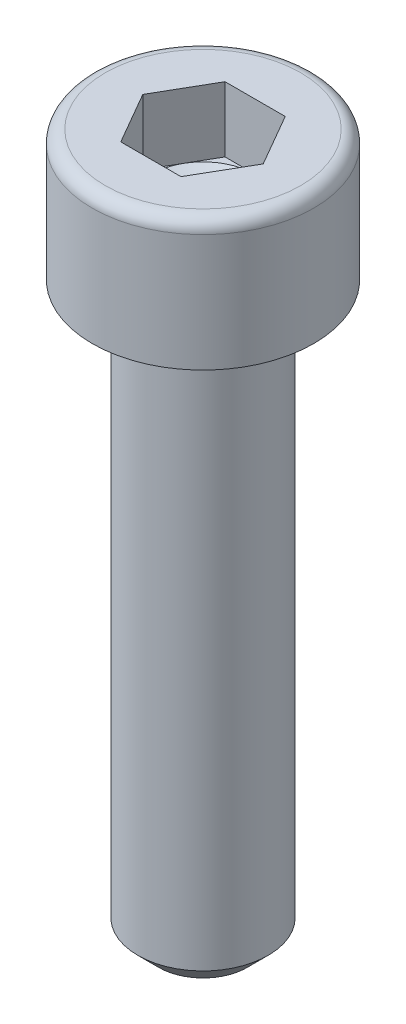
ISO-10303-21;
HEADER;
FILE_DESCRIPTION(('STEP AP214'),'2;1');
FILE_NAME('part.step','',(''),(''),'','','');
FILE_SCHEMA(('AUTOMOTIVE_DESIGN { 1 0 10303 214 1 1 1 1 }'));
ENDSEC;
DATA;
#1=APPLICATION_CONTEXT('core data for automotive mechanical design processes');
#2=APPLICATION_PROTOCOL_DEFINITION('international standard','automotive_design',2000,#1);
#3=PRODUCT_CONTEXT('',#1,'mechanical');
#4=PRODUCT('Part','Part','',(#3));
#5=PRODUCT_RELATED_PRODUCT_CATEGORY('part','',(#4));
#6=PRODUCT_DEFINITION_FORMATION('','',#4);
#7=PRODUCT_DEFINITION_CONTEXT('part definition',#1,'design');
#8=PRODUCT_DEFINITION('design','',#6,#7);
#9=PRODUCT_DEFINITION_SHAPE('','',#8);
#10=(LENGTH_UNIT() NAMED_UNIT(*) SI_UNIT(.MILLI.,.METRE.));
#11=(NAMED_UNIT(*) PLANE_ANGLE_UNIT() SI_UNIT($,.RADIAN.));
#12=(NAMED_UNIT(*) SI_UNIT($,.STERADIAN.) SOLID_ANGLE_UNIT());
#13=UNCERTAINTY_MEASURE_WITH_UNIT(LENGTH_MEASURE(1.E-05),#10,'distance_accuracy_value','');
#14=(GEOMETRIC_REPRESENTATION_CONTEXT(3) GLOBAL_UNCERTAINTY_ASSIGNED_CONTEXT((#13)) GLOBAL_UNIT_ASSIGNED_CONTEXT((#10,
#11,#12)) REPRESENTATION_CONTEXT('',''));
#15=CARTESIAN_POINT('',(0.,0.,0.));
#16=DIRECTION('',(0.,0.,1.));
#17=DIRECTION('',(1.,0.,0.));
#18=AXIS2_PLACEMENT_3D('',#15,#16,#17);
#19=CARTESIAN_POINT('',(-3.46410161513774,2.5,2.));
#20=DIRECTION('',(0.,-1.,0.));
#21=DIRECTION('',(0.,0.,-1.));
#22=AXIS2_PLACEMENT_3D('',#19,#20,#21);
#23=PLANE('',#22);
#24=DIRECTION('',(-0.499999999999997,0.,0.86602540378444));
#25=VECTOR('',#24,1.);
#26=CARTESIAN_POINT('',(1.73205080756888,2.5,0.999999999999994));
#27=LINE('',#26,#25);
#28=CARTESIAN_POINT('',(1.73205080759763,2.49999999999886,1.00000000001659));
#29=VERTEX_POINT('',#28);
#30=CARTESIAN_POINT('',(1.15470053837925,2.5,2.));
#31=VERTEX_POINT('',#30);
#32=EDGE_CURVE('E102',#29,#31,#27,.T.);
#33=ORIENTED_EDGE('',*,*,#32,.F.);
#34=CARTESIAN_POINT('',(0.,2.49999999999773,0.));
#35=DIRECTION('',(0.,1.,0.));
#36=DIRECTION('',(-1.,0.,0.));
#37=AXIS2_PLACEMENT_3D('',#34,#35,#36);
#38=CIRCLE('',#37,2.00000000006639);
#39=CARTESIAN_POINT('',(0.,2.49999999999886,2.0000000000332));
#40=VERTEX_POINT('',#39);
#41=EDGE_CURVE('E110',#29,#40,#38,.F.);
#42=ORIENTED_EDGE('',*,*,#41,.T.);
#43=DIRECTION('',(1.,0.,0.));
#44=VECTOR('',#43,1.);
#45=CARTESIAN_POINT('',(-3.46410161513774,2.5,2.));
#46=LINE('',#45,#44);
#47=EDGE_CURVE('E79',#31,#40,#46,.F.);
#48=ORIENTED_EDGE('',*,*,#47,.F.);
#49=EDGE_LOOP('',(#33,#42,#48));
#50=FACE_BOUND('',#49,.T.);
#51=ADVANCED_FACE('F16',(#50),#23,.F.);
#52=CARTESIAN_POINT('',(-3.46410161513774,2.5,2.));
#53=DIRECTION('',(0.,-1.,0.));
#54=DIRECTION('',(0.,0.,-1.));
#55=AXIS2_PLACEMENT_3D('',#52,#53,#54);
#56=PLANE('',#55);
#57=DIRECTION('',(1.,0.,0.));
#58=VECTOR('',#57,1.);
#59=CARTESIAN_POINT('',(-3.46410161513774,2.5,2.));
#60=LINE('',#59,#58);
#61=CARTESIAN_POINT('',(-1.15470053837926,2.5,2.));
#62=VERTEX_POINT('',#61);
#63=EDGE_CURVE('E261',#40,#62,#60,.F.);
#64=ORIENTED_EDGE('',*,*,#63,.F.);
#65=CARTESIAN_POINT('',(0.,2.49999999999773,0.));
#66=DIRECTION('',(0.,1.,0.));
#67=DIRECTION('',(-1.,0.,0.));
#68=AXIS2_PLACEMENT_3D('',#65,#66,#67);
#69=CIRCLE('',#68,2.00000000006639);
#70=CARTESIAN_POINT('',(-1.73205080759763,2.49999999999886,1.00000000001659));
#71=VERTEX_POINT('',#70);
#72=EDGE_CURVE('E116',#40,#71,#69,.F.);
#73=ORIENTED_EDGE('',*,*,#72,.T.);
#74=DIRECTION('',(-0.499999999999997,0.,-0.86602540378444));
#75=VECTOR('',#74,1.);
#76=CARTESIAN_POINT('',(-1.15470053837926,2.5,2.));
#77=LINE('',#76,#75);
#78=EDGE_CURVE('E259',#62,#71,#77,.T.);
#79=ORIENTED_EDGE('',*,*,#78,.F.);
#80=EDGE_LOOP('',(#64,#73,#79));
#81=FACE_BOUND('',#80,.T.);
#82=ADVANCED_FACE('F263',(#81),#56,.F.);
#83=CARTESIAN_POINT('',(-3.46410161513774,2.5,2.));
#84=DIRECTION('',(0.,-1.,0.));
#85=DIRECTION('',(0.,0.,-1.));
#86=AXIS2_PLACEMENT_3D('',#83,#84,#85);
#87=PLANE('',#86);
#88=DIRECTION('',(1.,0.,0.));
#89=VECTOR('',#88,1.);
#90=CARTESIAN_POINT('',(-3.46410161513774,2.5,-2.));
#91=LINE('',#90,#89);
#92=CARTESIAN_POINT('',(0.,2.49999999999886,-2.0000000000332));
#93=VERTEX_POINT('',#92);
#94=CARTESIAN_POINT('',(1.15470053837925,2.5,-2.));
#95=VERTEX_POINT('',#94);
#96=EDGE_CURVE('E121',#93,#95,#91,.T.);
#97=ORIENTED_EDGE('',*,*,#96,.F.);
#98=CARTESIAN_POINT('',(0.,2.49999999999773,0.));
#99=DIRECTION('',(0.,1.,0.));
#100=DIRECTION('',(-1.,0.,0.));
#101=AXIS2_PLACEMENT_3D('',#98,#99,#100);
#102=CIRCLE('',#101,2.00000000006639);
#103=CARTESIAN_POINT('',(1.73205080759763,2.49999999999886,-1.00000000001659));
#104=VERTEX_POINT('',#103);
#105=EDGE_CURVE('E96',#93,#104,#102,.F.);
#106=ORIENTED_EDGE('',*,*,#105,.T.);
#107=DIRECTION('',(0.499999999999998,0.,0.86602540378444));
#108=VECTOR('',#107,1.);
#109=CARTESIAN_POINT('',(1.15470053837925,2.5,-2.));
#110=LINE('',#109,#108);
#111=EDGE_CURVE('E117',#95,#104,#110,.T.);
#112=ORIENTED_EDGE('',*,*,#111,.F.);
#113=EDGE_LOOP('',(#97,#106,#112));
#114=FACE_BOUND('',#113,.T.);
#115=ADVANCED_FACE('F285',(#114),#87,.F.);
#116=CARTESIAN_POINT('',(0.,2.49999999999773,0.));
#117=DIRECTION('',(0.,1.,0.));
#118=DIRECTION('',(-1.,0.,0.));
#119=AXIS2_PLACEMENT_3D('',#116,#117,#118);
#120=CONICAL_SURFACE('',#119,2.00000000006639,1.04719755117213);
#121=CARTESIAN_POINT('',(-7.105427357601E-11,1.34529946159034,0.));
#122=VERTEX_POINT('',#121);
#123=VERTEX_LOOP('',#122);
#124=FACE_BOUND('',#123,.T.);
#125=ORIENTED_EDGE('',*,*,#41,.F.);
#126=CARTESIAN_POINT('',(0.,2.49999999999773,0.));
#127=DIRECTION('',(0.,1.,0.));
#128=DIRECTION('',(-1.,0.,0.));
#129=AXIS2_PLACEMENT_3D('',#126,#127,#128);
#130=CIRCLE('',#129,2.00000000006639);
#131=EDGE_CURVE('E85',#104,#29,#130,.F.);
#132=ORIENTED_EDGE('',*,*,#131,.F.);
#133=ORIENTED_EDGE('',*,*,#105,.F.);
#134=CARTESIAN_POINT('',(0.,2.49999999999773,0.));
#135=DIRECTION('',(0.,1.,0.));
#136=DIRECTION('',(-1.,0.,0.));
#137=AXIS2_PLACEMENT_3D('',#134,#135,#136);
#138=CIRCLE('',#137,2.00000000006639);
#139=CARTESIAN_POINT('',(-1.73205080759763,2.49999999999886,-1.00000000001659));
#140=VERTEX_POINT('',#139);
#141=EDGE_CURVE('E95',#93,#140,#138,.T.);
#142=ORIENTED_EDGE('',*,*,#141,.T.);
#143=CARTESIAN_POINT('',(0.,2.49999999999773,0.));
#144=DIRECTION('',(0.,1.,0.));
#145=DIRECTION('',(-1.,0.,0.));
#146=AXIS2_PLACEMENT_3D('',#143,#144,#145);
#147=CIRCLE('',#146,2.00000000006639);
#148=EDGE_CURVE('E119',#71,#140,#147,.F.);
#149=ORIENTED_EDGE('',*,*,#148,.F.);
#150=ORIENTED_EDGE('',*,*,#72,.F.);
#151=EDGE_LOOP('',(#125,#132,#133,#142,#149,#150));
#152=FACE_BOUND('',#151,.T.);
#153=ADVANCED_FACE('F114',(#124,#152),#120,.F.);
#154=CARTESIAN_POINT('',(-3.46410161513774,2.5,2.));
#155=DIRECTION('',(0.,-1.,0.));
#156=DIRECTION('',(0.,0.,-1.));
#157=AXIS2_PLACEMENT_3D('',#154,#155,#156);
#158=PLANE('',#157);
#159=DIRECTION('',(0.499999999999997,0.,-0.86602540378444));
#160=VECTOR('',#159,1.);
#161=CARTESIAN_POINT('',(-1.15470053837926,2.5,-2.));
#162=LINE('',#161,#160);
#163=CARTESIAN_POINT('',(-1.15470053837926,2.5,-2.));
#164=VERTEX_POINT('',#163);
#165=EDGE_CURVE('E203',#140,#164,#162,.T.);
#166=ORIENTED_EDGE('',*,*,#165,.F.);
#167=ORIENTED_EDGE('',*,*,#141,.F.);
#168=DIRECTION('',(1.,0.,0.));
#169=VECTOR('',#168,1.);
#170=CARTESIAN_POINT('',(1.15470053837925,2.5,-2.));
#171=LINE('',#170,#169);
#172=EDGE_CURVE('E204',#164,#93,#171,.T.);
#173=ORIENTED_EDGE('',*,*,#172,.F.);
#174=EDGE_LOOP('',(#166,#167,#173));
#175=FACE_BOUND('',#174,.T.);
#176=ADVANCED_FACE('F245',(#175),#158,.F.);
#177=CARTESIAN_POINT('',(-3.46410161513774,2.5,2.));
#178=DIRECTION('',(0.,-1.,0.));
#179=DIRECTION('',(0.,0.,-1.));
#180=AXIS2_PLACEMENT_3D('',#177,#178,#179);
#181=PLANE('',#180);
#182=DIRECTION('',(-0.499999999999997,0.,-0.86602540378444));
#183=VECTOR('',#182,1.);
#184=CARTESIAN_POINT('',(-1.15470053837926,2.5,2.));
#185=LINE('',#184,#183);
#186=CARTESIAN_POINT('',(-2.3094010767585,2.5,0.));
#187=VERTEX_POINT('',#186);
#188=EDGE_CURVE('E189',#71,#187,#185,.T.);
#189=ORIENTED_EDGE('',*,*,#188,.F.);
#190=ORIENTED_EDGE('',*,*,#148,.T.);
#191=DIRECTION('',(0.499999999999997,0.,-0.86602540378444));
#192=VECTOR('',#191,1.);
#193=CARTESIAN_POINT('',(-1.15470053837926,2.5,-2.));
#194=LINE('',#193,#192);
#195=EDGE_CURVE('E200',#187,#140,#194,.T.);
#196=ORIENTED_EDGE('',*,*,#195,.F.);
#197=EDGE_LOOP('',(#189,#190,#196));
#198=FACE_BOUND('',#197,.T.);
#199=ADVANCED_FACE('F239',(#198),#181,.F.);
#200=CARTESIAN_POINT('',(-3.46410161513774,2.5,2.));
#201=DIRECTION('',(0.,-1.,0.));
#202=DIRECTION('',(0.,0.,-1.));
#203=AXIS2_PLACEMENT_3D('',#200,#201,#202);
#204=PLANE('',#203);
#205=DIRECTION('',(0.499999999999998,0.,0.86602540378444));
#206=VECTOR('',#205,1.);
#207=CARTESIAN_POINT('',(1.15470053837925,2.5,-2.));
#208=LINE('',#207,#206);
#209=CARTESIAN_POINT('',(2.3094010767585,2.5,0.));
#210=VERTEX_POINT('',#209);
#211=EDGE_CURVE('E91',#104,#210,#208,.T.);
#212=ORIENTED_EDGE('',*,*,#211,.F.);
#213=ORIENTED_EDGE('',*,*,#131,.T.);
#214=DIRECTION('',(-0.499999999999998,0.,0.86602540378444));
#215=VECTOR('',#214,1.);
#216=CARTESIAN_POINT('',(1.15470053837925,2.5,2.));
#217=LINE('',#216,#215);
#218=EDGE_CURVE('E88',#210,#29,#217,.T.);
#219=ORIENTED_EDGE('',*,*,#218,.F.);
#220=EDGE_LOOP('',(#212,#213,#219));
#221=FACE_BOUND('',#220,.T.);
#222=ADVANCED_FACE('F87',(#221),#204,.F.);
#223=CARTESIAN_POINT('',(1.15470053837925,2.5,-2.));
#224=DIRECTION('',(0.,0.,1.));
#225=DIRECTION('',(1.,0.,0.));
#226=AXIS2_PLACEMENT_3D('',#223,#224,#225);
#227=PLANE('',#226);
#228=ORIENTED_EDGE('',*,*,#96,.T.);
#229=DIRECTION('',(0.,1.,0.));
#230=VECTOR('',#229,1.);
#231=CARTESIAN_POINT('',(1.15470053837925,2.5,-2.));
#232=LINE('',#231,#230);
#233=CARTESIAN_POINT('',(1.15470053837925,5.,-2.));
#234=VERTEX_POINT('',#233);
#235=EDGE_CURVE('E181',#234,#95,#232,.F.);
#236=ORIENTED_EDGE('',*,*,#235,.F.);
#237=DIRECTION('',(1.,0.,0.));
#238=VECTOR('',#237,1.);
#239=CARTESIAN_POINT('',(2.,5.,-2.));
#240=LINE('',#239,#238);
#241=CARTESIAN_POINT('',(-1.15470053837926,5.,-2.));
#242=VERTEX_POINT('',#241);
#243=EDGE_CURVE('E165',#234,#242,#240,.F.);
#244=ORIENTED_EDGE('',*,*,#243,.T.);
#245=DIRECTION('',(0.,1.,0.));
#246=VECTOR('',#245,1.);
#247=CARTESIAN_POINT('',(-1.15470053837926,2.5,-2.));
#248=LINE('',#247,#246);
#249=EDGE_CURVE('E193',#164,#242,#248,.T.);
#250=ORIENTED_EDGE('',*,*,#249,.F.);
#251=ORIENTED_EDGE('',*,*,#172,.T.);
#252=EDGE_LOOP('',(#228,#236,#244,#250,#251));
#253=FACE_BOUND('',#252,.T.);
#254=ADVANCED_FACE('F277',(#253),#227,.T.);
#255=CARTESIAN_POINT('',(-1.15470053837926,2.5,-2.));
#256=DIRECTION('',(0.86602540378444,0.,0.499999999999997));
#257=DIRECTION('',(0.499999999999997,0.,-0.86602540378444));
#258=AXIS2_PLACEMENT_3D('',#255,#256,#257);
#259=PLANE('',#258);
#260=ORIENTED_EDGE('',*,*,#165,.T.);
#261=ORIENTED_EDGE('',*,*,#249,.T.);
#262=DIRECTION('',(-0.499999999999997,0.,0.86602540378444));
#263=VECTOR('',#262,1.);
#264=CARTESIAN_POINT('',(-1.15470053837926,5.,-2.));
#265=LINE('',#264,#263);
#266=CARTESIAN_POINT('',(-2.3094010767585,5.,0.));
#267=VERTEX_POINT('',#266);
#268=EDGE_CURVE('E252',#242,#267,#265,.T.);
#269=ORIENTED_EDGE('',*,*,#268,.T.);
#270=DIRECTION('',(0.,1.,0.));
#271=VECTOR('',#270,1.);
#272=CARTESIAN_POINT('',(-2.3094010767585,2.5,0.));
#273=LINE('',#272,#271);
#274=EDGE_CURVE('E192',#187,#267,#273,.T.);
#275=ORIENTED_EDGE('',*,*,#274,.F.);
#276=ORIENTED_EDGE('',*,*,#195,.T.);
#277=EDGE_LOOP('',(#260,#261,#269,#275,#276));
#278=FACE_BOUND('',#277,.T.);
#279=ADVANCED_FACE('F248',(#278),#259,.T.);
#280=CARTESIAN_POINT('',(-1.15470053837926,2.5,2.));
#281=DIRECTION('',(0.86602540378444,0.,-0.499999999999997));
#282=DIRECTION('',(-0.499999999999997,0.,-0.86602540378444));
#283=AXIS2_PLACEMENT_3D('',#280,#281,#282);
#284=PLANE('',#283);
#285=ORIENTED_EDGE('',*,*,#188,.T.);
#286=ORIENTED_EDGE('',*,*,#274,.T.);
#287=DIRECTION('',(0.499999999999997,0.,0.86602540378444));
#288=VECTOR('',#287,1.);
#289=CARTESIAN_POINT('',(-2.3094010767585,5.,0.));
#290=LINE('',#289,#288);
#291=CARTESIAN_POINT('',(-1.15470053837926,5.,2.));
#292=VERTEX_POINT('',#291);
#293=EDGE_CURVE('E434',#267,#292,#290,.T.);
#294=ORIENTED_EDGE('',*,*,#293,.T.);
#295=DIRECTION('',(0.,1.,0.));
#296=VECTOR('',#295,1.);
#297=CARTESIAN_POINT('',(-1.15470053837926,2.5,2.));
#298=LINE('',#297,#296);
#299=EDGE_CURVE('E107',#62,#292,#298,.T.);
#300=ORIENTED_EDGE('',*,*,#299,.F.);
#301=ORIENTED_EDGE('',*,*,#78,.T.);
#302=EDGE_LOOP('',(#285,#286,#294,#300,#301));
#303=FACE_BOUND('',#302,.T.);
#304=ADVANCED_FACE('F256',(#303),#284,.T.);
#305=CARTESIAN_POINT('',(1.15470053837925,2.5,2.));
#306=DIRECTION('',(0.,0.,-1.));
#307=DIRECTION('',(-1.,0.,0.));
#308=AXIS2_PLACEMENT_3D('',#305,#306,#307);
#309=PLANE('',#308);
#310=ORIENTED_EDGE('',*,*,#63,.T.);
#311=ORIENTED_EDGE('',*,*,#299,.T.);
#312=DIRECTION('',(1.,0.,0.));
#313=VECTOR('',#312,1.);
#314=CARTESIAN_POINT('',(2.,5.,2.));
#315=LINE('',#314,#313);
#316=CARTESIAN_POINT('',(1.15470053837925,5.,2.));
#317=VERTEX_POINT('',#316);
#318=EDGE_CURVE('E435',#292,#317,#315,.T.);
#319=ORIENTED_EDGE('',*,*,#318,.T.);
#320=DIRECTION('',(0.,1.,0.));
#321=VECTOR('',#320,1.);
#322=CARTESIAN_POINT('',(1.15470053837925,2.5,2.));
#323=LINE('',#322,#321);
#324=EDGE_CURVE('E106',#31,#317,#323,.T.);
#325=ORIENTED_EDGE('',*,*,#324,.F.);
#326=ORIENTED_EDGE('',*,*,#47,.T.);
#327=EDGE_LOOP('',(#310,#311,#319,#325,#326));
#328=FACE_BOUND('',#327,.T.);
#329=ADVANCED_FACE('F358',(#328),#309,.T.);
#330=CARTESIAN_POINT('',(1.15470053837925,2.5,2.));
#331=DIRECTION('',(-0.86602540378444,0.,-0.499999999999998));
#332=DIRECTION('',(-0.499999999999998,0.,0.86602540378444));
#333=AXIS2_PLACEMENT_3D('',#330,#331,#332);
#334=PLANE('',#333);
#335=ORIENTED_EDGE('',*,*,#32,.T.);
#336=ORIENTED_EDGE('',*,*,#324,.T.);
#337=DIRECTION('',(0.499999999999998,0.,-0.86602540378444));
#338=VECTOR('',#337,1.);
#339=CARTESIAN_POINT('',(1.15470053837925,5.,2.));
#340=LINE('',#339,#338);
#341=CARTESIAN_POINT('',(2.3094010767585,5.,0.));
#342=VERTEX_POINT('',#341);
#343=EDGE_CURVE('E438',#317,#342,#340,.T.);
#344=ORIENTED_EDGE('',*,*,#343,.T.);
#345=DIRECTION('',(0.,1.,0.));
#346=VECTOR('',#345,1.);
#347=CARTESIAN_POINT('',(2.3094010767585,2.5,0.));
#348=LINE('',#347,#346);
#349=EDGE_CURVE('E105',#210,#342,#348,.T.);
#350=ORIENTED_EDGE('',*,*,#349,.F.);
#351=ORIENTED_EDGE('',*,*,#218,.T.);
#352=EDGE_LOOP('',(#335,#336,#344,#350,#351));
#353=FACE_BOUND('',#352,.T.);
#354=ADVANCED_FACE('F100',(#353),#334,.T.);
#355=CARTESIAN_POINT('',(1.15470053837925,2.5,-2.));
#356=DIRECTION('',(-0.86602540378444,0.,0.499999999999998));
#357=DIRECTION('',(0.499999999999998,0.,0.86602540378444));
#358=AXIS2_PLACEMENT_3D('',#355,#356,#357);
#359=PLANE('',#358);
#360=ORIENTED_EDGE('',*,*,#211,.T.);
#361=ORIENTED_EDGE('',*,*,#349,.T.);
#362=DIRECTION('',(-0.499999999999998,0.,-0.86602540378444));
#363=VECTOR('',#362,1.);
#364=CARTESIAN_POINT('',(2.3094010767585,5.,0.));
#365=LINE('',#364,#363);
#366=EDGE_CURVE('E129',#342,#234,#365,.T.);
#367=ORIENTED_EDGE('',*,*,#366,.T.);
#368=ORIENTED_EDGE('',*,*,#235,.T.);
#369=ORIENTED_EDGE('',*,*,#111,.T.);
#370=EDGE_LOOP('',(#360,#361,#367,#368,#369));
#371=FACE_BOUND('',#370,.T.);
#372=ADVANCED_FACE('F150',(#371),#359,.T.);
#373=CARTESIAN_POINT('',(2.,5.,0.));
#374=DIRECTION('',(0.,-1.,0.));
#375=DIRECTION('',(1.,0.,0.));
#376=AXIS2_PLACEMENT_3D('',#373,#374,#375);
#377=PLANE('',#376);
#378=ORIENTED_EDGE('',*,*,#343,.F.);
#379=ORIENTED_EDGE('',*,*,#318,.F.);
#380=ORIENTED_EDGE('',*,*,#293,.F.);
#381=ORIENTED_EDGE('',*,*,#268,.F.);
#382=ORIENTED_EDGE('',*,*,#243,.F.);
#383=ORIENTED_EDGE('',*,*,#366,.F.);
#384=EDGE_LOOP('',(#378,#379,#380,#381,#382,#383));
#385=FACE_BOUND('',#384,.T.);
#386=CARTESIAN_POINT('',(0.,5.,0.));
#387=DIRECTION('',(0.,-1.,0.));
#388=DIRECTION('',(-1.,0.,0.));
#389=AXIS2_PLACEMENT_3D('',#386,#387,#388);
#390=CIRCLE('',#389,3.75);
#391=CARTESIAN_POINT('',(-3.75,5.,0.));
#392=VERTEX_POINT('',#391);
#393=CARTESIAN_POINT('',(3.75,5.,0.));
#394=VERTEX_POINT('',#393);
#395=EDGE_CURVE('E36',#392,#394,#390,.T.);
#396=ORIENTED_EDGE('',*,*,#395,.F.);
#397=CARTESIAN_POINT('',(0.,5.,0.));
#398=DIRECTION('',(0.,-1.,0.));
#399=DIRECTION('',(1.,0.,0.));
#400=AXIS2_PLACEMENT_3D('',#397,#398,#399);
#401=CIRCLE('',#400,3.75);
#402=EDGE_CURVE('E127',#394,#392,#401,.T.);
#403=ORIENTED_EDGE('',*,*,#402,.F.);
#404=EDGE_LOOP('',(#396,#403));
#405=FACE_BOUND('',#404,.T.);
#406=ADVANCED_FACE('F131',(#385,#405),#377,.F.);
#407=CARTESIAN_POINT('',(0.,4.5,0.));
#408=DIRECTION('',(0.,1.,0.));
#409=DIRECTION('',(-1.,0.,0.));
#410=AXIS2_PLACEMENT_3D('',#407,#408,#409);
#411=TOROIDAL_SURFACE('',#410,3.75,0.5);
#412=ORIENTED_EDGE('',*,*,#395,.T.);
#413=ORIENTED_EDGE('',*,*,#402,.T.);
#414=EDGE_LOOP('',(#412,#413));
#415=FACE_BOUND('',#414,.T.);
#416=CARTESIAN_POINT('',(0.,4.5,0.));
#417=DIRECTION('',(0.,1.,0.));
#418=DIRECTION('',(-1.,0.,0.));
#419=AXIS2_PLACEMENT_3D('',#416,#417,#418);
#420=CIRCLE('',#419,4.25);
#421=CARTESIAN_POINT('',(-4.25,4.5,0.));
#422=VERTEX_POINT('',#421);
#423=EDGE_CURVE('E132',#422,#422,#420,.F.);
#424=ORIENTED_EDGE('',*,*,#423,.F.);
#425=EDGE_LOOP('',(#424));
#426=FACE_BOUND('',#425,.T.);
#427=ADVANCED_FACE('F125',(#415,#426),#411,.T.);
#428=CARTESIAN_POINT('',(0.,-22.,0.));
#429=DIRECTION('',(0.,1.,0.));
#430=DIRECTION('',(0.,0.,1.));
#431=AXIS2_PLACEMENT_3D('',#428,#429,#430);
#432=PLANE('',#431);
#433=CARTESIAN_POINT('',(0.,-21.9999999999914,0.));
#434=DIRECTION('',(0.,1.,0.));
#435=DIRECTION('',(0.,0.,1.));
#436=AXIS2_PLACEMENT_3D('',#433,#434,#435);
#437=CIRCLE('',#436,1.70000000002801);
#438=CARTESIAN_POINT('',(0.,-21.9999999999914,1.70000000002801));
#439=VERTEX_POINT('',#438);
#440=EDGE_CURVE('E171',#439,#439,#437,.T.);
#441=ORIENTED_EDGE('',*,*,#440,.F.);
#442=EDGE_LOOP('',(#441));
#443=FACE_BOUND('',#442,.T.);
#444=ADVANCED_FACE('F158',(#443),#432,.F.);
#445=CARTESIAN_POINT('',(0.,5.,0.));
#446=DIRECTION('',(0.,1.,0.));
#447=DIRECTION('',(-1.,0.,0.));
#448=AXIS2_PLACEMENT_3D('',#445,#446,#447);
#449=CYLINDRICAL_SURFACE('',#448,4.25);
#450=ORIENTED_EDGE('',*,*,#423,.T.);
#451=EDGE_LOOP('',(#450));
#452=FACE_BOUND('',#451,.T.);
#453=CARTESIAN_POINT('',(0.,0.,0.));
#454=DIRECTION('',(0.,1.,0.));
#455=DIRECTION('',(-1.,0.,0.));
#456=AXIS2_PLACEMENT_3D('',#453,#454,#455);
#457=CIRCLE('',#456,4.25);
#458=CARTESIAN_POINT('',(-4.25,0.,0.));
#459=VERTEX_POINT('',#458);
#460=EDGE_CURVE('E169',#459,#459,#457,.T.);
#461=ORIENTED_EDGE('',*,*,#460,.T.);
#462=EDGE_LOOP('',(#461));
#463=FACE_BOUND('',#462,.T.);
#464=ADVANCED_FACE('F310',(#452,#463),#449,.T.);
#465=CARTESIAN_POINT('',(0.,-21.2000000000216,0.));
#466=DIRECTION('',(0.,1.,0.));
#467=DIRECTION('',(0.,0.,1.));
#468=AXIS2_PLACEMENT_3D('',#465,#466,#467);
#469=CONICAL_SURFACE('',#468,2.49999999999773,0.785398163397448);
#470=ORIENTED_EDGE('',*,*,#440,.T.);
#471=EDGE_LOOP('',(#470));
#472=FACE_BOUND('',#471,.T.);
#473=CARTESIAN_POINT('',(0.,-21.2,0.));
#474=DIRECTION('',(0.,1.,0.));
#475=DIRECTION('',(0.,0.,1.));
#476=AXIS2_PLACEMENT_3D('',#473,#474,#475);
#477=CIRCLE('',#476,2.5);
#478=CARTESIAN_POINT('',(0.,-21.2,2.5));
#479=VERTEX_POINT('',#478);
#480=EDGE_CURVE('E28',#479,#479,#477,.T.);
#481=ORIENTED_EDGE('',*,*,#480,.F.);
#482=EDGE_LOOP('',(#481));
#483=FACE_BOUND('',#482,.T.);
#484=ADVANCED_FACE('F302',(#472,#483),#469,.T.);
#485=CARTESIAN_POINT('',(0.,0.,0.));
#486=DIRECTION('',(0.,1.,0.));
#487=DIRECTION('',(-1.,0.,0.));
#488=AXIS2_PLACEMENT_3D('',#485,#486,#487);
#489=PLANE('',#488);
#490=ORIENTED_EDGE('',*,*,#460,.F.);
#491=EDGE_LOOP('',(#490));
#492=FACE_BOUND('',#491,.T.);
#493=CARTESIAN_POINT('',(0.,0.,0.));
#494=DIRECTION('',(0.,1.,0.));
#495=DIRECTION('',(0.,0.,1.));
#496=AXIS2_PLACEMENT_3D('',#493,#494,#495);
#497=CIRCLE('',#496,2.5);
#498=CARTESIAN_POINT('',(0.,0.,2.5));
#499=VERTEX_POINT('',#498);
#500=EDGE_CURVE('E10',#499,#499,#497,.F.);
#501=ORIENTED_EDGE('',*,*,#500,.F.);
#502=EDGE_LOOP('',(#501));
#503=FACE_BOUND('',#502,.T.);
#504=ADVANCED_FACE('F297',(#492,#503),#489,.F.);
#505=CARTESIAN_POINT('',(0.,-22.,0.));
#506=DIRECTION('',(0.,1.,0.));
#507=DIRECTION('',(0.,0.,1.));
#508=AXIS2_PLACEMENT_3D('',#505,#506,#507);
#509=CYLINDRICAL_SURFACE('',#508,2.5);
#510=ORIENTED_EDGE('',*,*,#480,.T.);
#511=EDGE_LOOP('',(#510));
#512=FACE_BOUND('',#511,.T.);
#513=ORIENTED_EDGE('',*,*,#500,.T.);
#514=EDGE_LOOP('',(#513));
#515=FACE_BOUND('',#514,.T.);
#516=ADVANCED_FACE('F18',(#512,#515),#509,.T.);
#517=CLOSED_SHELL('',(#51,#82,#115,#153,#176,#199,#222,#254,#279,#304,#329,#354,#372,#406,#427,
#444,#464,#484,#504,#516));
#518=MANIFOLD_SOLID_BREP('B1',#517);
#519=ADVANCED_BREP_SHAPE_REPRESENTATION('',(#18,#518),#14);
#520=SHAPE_DEFINITION_REPRESENTATION(#9,#519);
ENDSEC;
END-ISO-10303-21;
